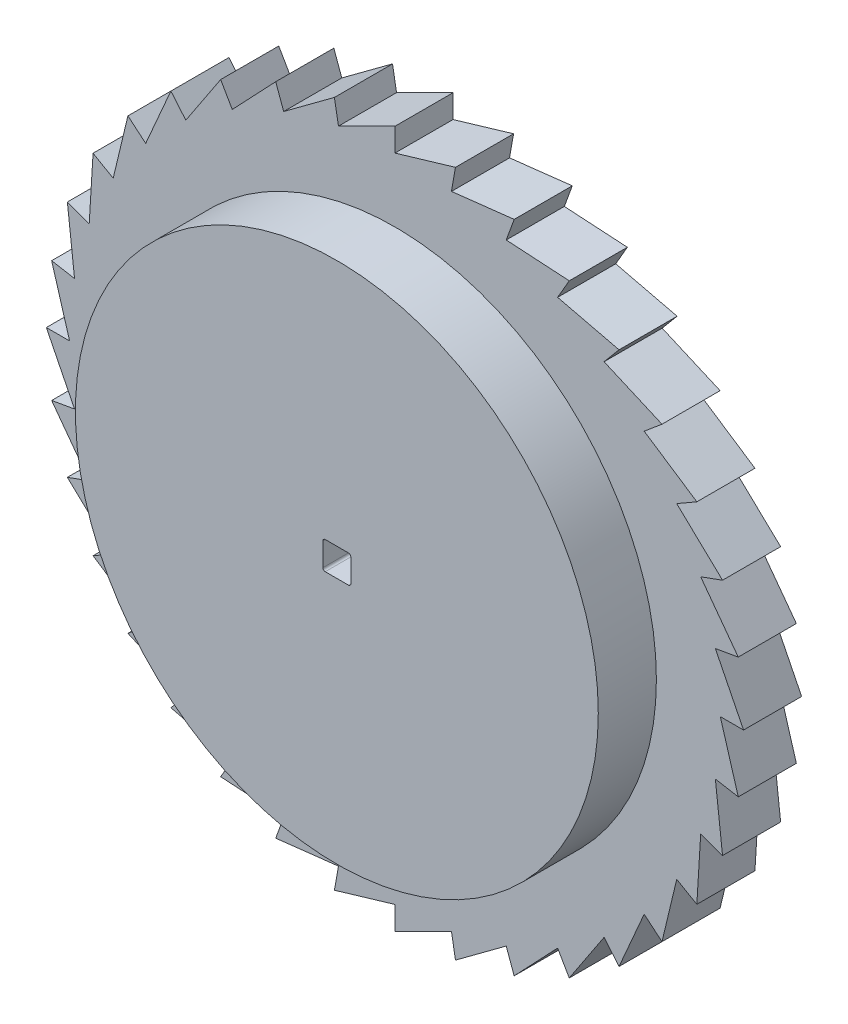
from build123d import *

# Parameters (mm, degrees)
BOSS_EXTRUDE1_DEPTH = 6.35
SKETCH2_R           = 28.575
BOSS_EXTRUDE2_DEPTH = 6.35
SKETCH3_W           = 3.048
SKETCH3_H           = 3.048
CUT_EXTRUDE1_DEPTH  = 56.358016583
FILLET1_R           = 0.254


with BuildPart() as part:
    # Sketch1 → Boss-Extrude1 (new body)
    with BuildSketch(Plane.XY):
        Polygon((6.174929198, 35.019763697), (13.030967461, 35.802288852), (12.162236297, 33.415469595), (19.05, 32.995567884), (17.78, 30.795863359), (24.490207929, 29.186293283), (22.8575274, 27.240540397), (29.186293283, 24.490207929), (27.240540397, 22.8575274), (32.995567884, 19.05), (30.795863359, 17.78), (35.802288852, 13.030967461), (33.415469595, 12.162236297), (37.52117539, 6.615995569), (35.019763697, 6.174929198), (38.1, 0), (35.56, 0), (37.52117539, -6.615995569), (35.019763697, -6.174929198), (35.802288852, -13.030967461), (33.415469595, -12.162236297), (32.995567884, -19.05), (30.795863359, -17.78), (29.186293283, -24.490207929), (27.240540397, -22.8575274), (24.490207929, -29.186293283), (22.8575274, -27.240540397), (19.05, -32.995567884), (17.78, -30.795863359), (13.030967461, -35.802288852), (12.162236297, -33.415469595), (6.615995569, -37.52117539), (6.174929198, -35.019763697), (0, -38.1), (0, -35.56), (-6.615995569, -37.52117539), (-6.174929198, -35.019763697), (-13.030967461, -35.802288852), (-12.162236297, -33.415469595), (-19.05, -32.995567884), (-17.78, -30.795863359), (-24.490207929, -29.186293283), (-22.8575274, -27.240540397), (-29.186293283, -24.490207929), (-27.240540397, -22.8575274), (-32.995567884, -19.05), (-30.795863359, -17.78), (-35.802288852, -13.030967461), (-33.415469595, -12.162236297), (-37.52117539, -6.615995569), (-35.019763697, -6.174929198), (-38.1, 0), (-35.56, 0), (-37.52117539, 6.615995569), (-35.019763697, 6.174929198), (-35.802288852, 13.030967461), (-33.415469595, 12.162236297), (-32.995567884, 19.05), (-30.795863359, 17.78), (-29.186293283, 24.490207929), (-27.240540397, 22.8575274), (-24.490207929, 29.186293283), (-22.8575274, 27.240540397), (-19.05, 32.995567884), (-17.78, 30.795863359), (-13.030967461, 35.802288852), (-12.162236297, 33.415469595), (-6.615995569, 37.52117539), (-6.174929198, 35.019763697), (0, 38.1), (0, 35.56), (6.615995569, 37.52117539), align=None)
    extrude(amount=BOSS_EXTRUDE1_DEPTH)

    # Sketch2 → Boss-Extrude2 (add)
    with BuildSketch(Plane.XY.offset(6.35)):
        Circle(SKETCH2_R)
    extrude(amount=BOSS_EXTRUDE2_DEPTH)

    # Sketch3 → Cut-Extrude1 (cut, through all)
    with BuildSketch(Plane(origin=(0, 0, 0), x_dir=(-1, 0, 0), z_dir=(0, 0, -1))):
        Rectangle(SKETCH3_W, SKETCH3_H)
    extrude(amount=-CUT_EXTRUDE1_DEPTH, mode=Mode.SUBTRACT)

    # Fillet1
    fillet1_edges = [part.edges().sort_by_distance(p)[0] for p in [
        (-1.524, 1.524, 6.35),
        (-1.524, -1.524, 6.35),
        (1.524, -1.524, 6.35),
        (1.524, 1.524, 6.35),
    ]]
    fillet(fillet1_edges, radius=FILLET1_R)


solid = part.part
